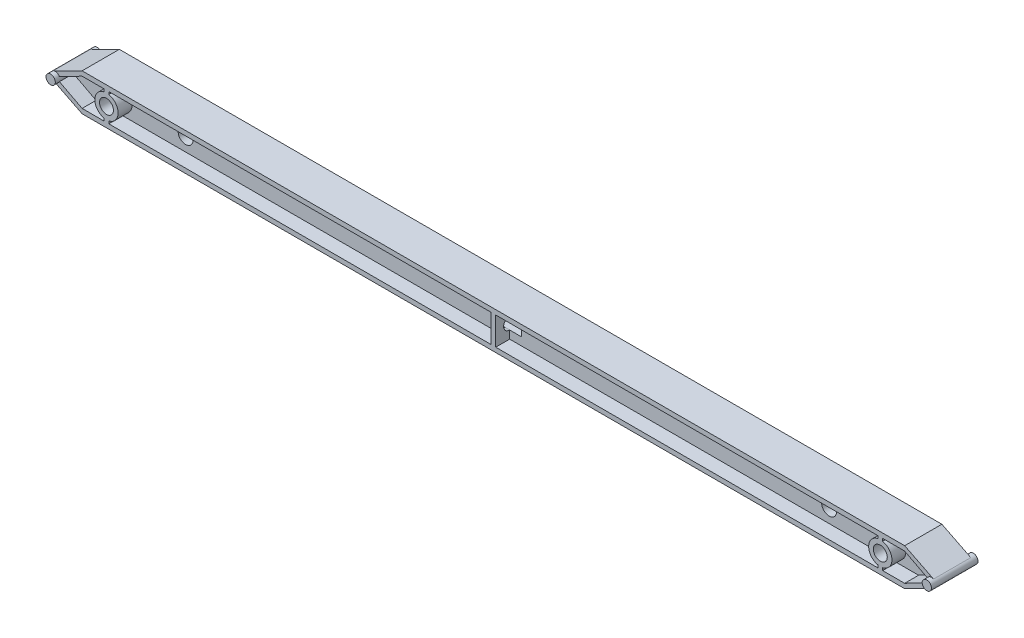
from build123d import *
from build123d.topology import SkipClean

# Parameters (mm, degrees)
SKETCH1_W           = 224.52581246
SKETCH1_H           = 5.08
BOSS_EXTRUDE3_DEPTH = 10.16
CUT_EXTRUDE1_DEPTH  = 3.81
BOSS_EXTRUDE4_START = 1.27
SKETCH6_R           = 1.27
BOSS_EXTRUDE4_DEPTH = 1.27
CUT_EXTRUDE2_DEPTH  = 171.591243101
SKETCH9_R           = 1.27
BOSS_EXTRUDE5_DEPTH = 1.27
CUT_EXTRUDE3_START  = -3.81
CUT_EXTRUDE3_DEPTH  = 3.81
SKETCH11_R          = 1.905
SKETCH11_R_2        = 2.032
SKETCH11_W          = 7.62
SKETCH11_H          = 3.302
CUT_EXTRUDE5_DEPTH  = 169.891306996
BOSS_EXTRUDE6_START = 3.81
SKETCH12_R          = 1.905
SKETCH12_W          = 1.27
SKETCH12_H          = 7.62
BOSS_EXTRUDE6_DEPTH = 3.81
SKETCH13_R          = 1.651
CUT_EXTRUDE6_DEPTH  = 3.81
BOSS_EXTRUDE7_DEPTH = 3.81


with BuildPart() as part:
    # Sketch1 → Boss-Extrude3 (new body)
    with BuildSketch(Plane.XY):
        Polygon((-64.473180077, 5.08), (-74.633180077, 0), (-64.473180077, 0), align=None)
        Polygon((-64.473180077, 0), (-74.633180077, 0), (-64.473180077, -5.08), align=None)
        with Locations((47.789726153, 2.54)):
            Rectangle(SKETCH1_W, SKETCH1_H)
        with Locations((47.789726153, -2.54)):
            Rectangle(SKETCH1_W, SKETCH1_H)
        Polygon((170.212632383, 0), (160.052632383, 0), (160.052632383, -5.08), align=None)
        Polygon((160.052632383, 5.08), (160.052632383, 0), (170.212632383, 0), align=None)
    extrude(amount=BOSS_EXTRUDE3_DEPTH)

    # Sketch4 → Cut-Extrude1 (cut)
    with BuildSketch(Plane.XY.offset(10.16)):
        with BuildLine():
            Line((166.246281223, 0.586341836), (160.052632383, 3.81))
            Line((160.052632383, 3.81), (-64.473180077, 3.81))
            Line((-64.473180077, 3.81), (-70.666828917, 0.586341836))
            ThreePointArc((-70.666828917, 0.586341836), (-70.559758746, 0.301817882), (-70.523373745, 0))
            ThreePointArc((-70.523373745, 0), (-70.559758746, -0.301817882), (-70.666828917, -0.586341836))
            Line((-70.666828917, -0.586341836), (-64.473180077, -3.81))
            Line((-64.473180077, -3.81), (160.052632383, -3.81))
            Line((160.052632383, -3.81), (166.246281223, -0.586341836))
            ThreePointArc((166.246281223, -0.586341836), (166.102826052, 0), (166.246281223, 0.586341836))
        make_face()
    extrude(amount=-CUT_EXTRUDE1_DEPTH, mode=Mode.SUBTRACT)

    # Sketch6 → Boss-Extrude4 (add)
    with SkipClean():  # the faces are left unmerged after this step: merging them gives an invalid solid
        with BuildSketch(Plane.XY.offset(10.16).offset(BOSS_EXTRUDE4_START)):
            with Locations((-71.793373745, 0)):
                Circle(SKETCH6_R)
            with Locations((167.372826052, 0)):
                Circle(SKETCH6_R)
        extrude(amount=-BOSS_EXTRUDE4_DEPTH)

    # Sketch7 → Cut-Extrude2 (cut, through all)
    with SkipClean():  # the faces are left unmerged after this step: merging them gives an invalid solid
        with BuildSketch(Plane.XY.offset(10.16)):
            with BuildLine():
                Line((170.212632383, 0), (167.940787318, 1.135922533))
                ThreePointArc((167.940787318, 1.135922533), (168.642826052, 0), (167.940787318, -1.135922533))
                Line((167.940787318, -1.135922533), (170.212632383, 0))
            make_face()
            with BuildLine():
                Line((-72.361335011, 1.135922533), (-74.633180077, 0))
                Line((-74.633180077, 0), (-72.361335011, -1.135922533))
                ThreePointArc((-72.361335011, -1.135922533), (-73.063373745, 0), (-72.361335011, 1.135922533))
            make_face()
        extrude(amount=-CUT_EXTRUDE2_DEPTH, mode=Mode.SUBTRACT)

    # Sketch9 → Boss-Extrude5 (add)
    with BuildSketch(Plane(origin=(0, 0, 0), x_dir=(-1, 0, 0), z_dir=(0, 0, -1))):
        with Locations(Location((-167.372826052, 0, 0), (0, 0, 180))):
            Circle(SKETCH9_R)
        with Locations(Location((71.793373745, 0, 0), (0, 0, 180))):
            Circle(SKETCH9_R)
    extrude(amount=BOSS_EXTRUDE5_DEPTH)

    # Sketch10 → Cut-Extrude3 (cut)
    with SkipClean():  # the faces are left unmerged after this step: merging them gives an invalid solid
        with BuildSketch(Plane(origin=(0, 0, 0), x_dir=(-1, 0, 0), z_dir=(0, 0, -1)).offset(CUT_EXTRUDE3_START)):
            with BuildLine():
                Line((64.473180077, 3.81), (-160.052632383, 3.81))
                Line((-160.052632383, 3.81), (-166.102826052, 1e-09))
                Line((-166.102826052, -1e-09), (-160.052632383, -3.81))
                Line((-160.052632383, -3.81), (64.473180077, -3.81))
                Line((64.473180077, -3.81), (70.666828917, -0.586341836))
                ThreePointArc((70.666828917, -0.586341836), (70.559758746, -0.301817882), (70.523373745, 0))
                ThreePointArc((70.523373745, 0), (70.559758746, 0.301817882), (70.666828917, 0.586341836))
                Line((70.666828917, 0.586341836), (64.473180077, 3.81))
            make_face()
        extrude(amount=CUT_EXTRUDE3_DEPTH, mode=Mode.SUBTRACT)

    # Sketch11 → Cut-Extrude5 (cut, through all)
    with SkipClean():  # the faces are left unmerged after this step: merging them gives an invalid solid
        with BuildSketch(Plane.XY.offset(6.35)):
            with Locations((-57.823373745, 0)):
                Circle(SKETCH11_R)
            with Locations((153.402826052, 0)):
                Circle(SKETCH11_R)
            with Locations((135.622826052, 0)):
                Circle(SKETCH11_R_2)
            with Locations((47.789726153, 0)):
                Rectangle(SKETCH11_W, SKETCH11_H)
            with Locations((-40.043373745, 0)):
                Circle(SKETCH11_R_2)
        extrude(amount=-CUT_EXTRUDE5_DEPTH, mode=Mode.SUBTRACT)

    # Sketch12 → Boss-Extrude6 (add)
    # profile 1 of 3: a face of its own
    with SkipClean():  # the faces are left unmerged after this step: merging them gives an invalid solid
        with BuildSketch(Plane.XY.offset(6.35).offset(BOSS_EXTRUDE6_START)):
            with BuildLine():
                Line((-57.188373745, 3.81), (-58.458373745, 3.81))
                Line((-58.458373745, 3.81), (-58.458373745, 3.110851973))
                ThreePointArc((-58.458373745, 3.110851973), (-60.998373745, 0), (-58.458373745, -3.110851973))
                Line((-58.458373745, -3.110851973), (-58.458373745, -3.81))
                Line((-58.458373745, -3.81), (-57.188373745, -3.81))
                Line((-57.188373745, -3.81), (-57.188373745, -3.110851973))
                ThreePointArc((-57.188373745, -3.110851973), (-54.648373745, 0), (-57.188373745, 3.110851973))
                Line((-57.188373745, 3.110851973), (-57.188373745, 3.81))
            make_face()
            with Locations((-57.823373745, 0)):
                Circle(SKETCH12_R, mode=Mode.SUBTRACT)
        # profile 2 of 3: a face of its own
        with BuildSketch(Plane.XY.offset(6.35).offset(BOSS_EXTRUDE6_START)):
            with Locations((47.789726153, 0)):
                Rectangle(SKETCH12_W, SKETCH12_H)
        # profile 3 of 3: a face of its own
        with BuildSketch(Plane.XY.offset(6.35).offset(BOSS_EXTRUDE6_START)):
            with BuildLine():
                Line((154.037826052, 3.81), (152.767826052, 3.81))
                Line((152.767826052, 3.81), (152.767826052, 3.110851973))
                ThreePointArc((152.767826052, 3.110851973), (150.227826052, 0), (152.767826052, -3.110851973))
                Line((152.767826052, -3.110851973), (152.767826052, -3.81))
                Line((152.767826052, -3.81), (154.037826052, -3.81))
                Line((154.037826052, -3.81), (154.037826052, -3.110851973))
                ThreePointArc((154.037826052, -3.110851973), (156.577826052, 0), (154.037826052, 3.110851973))
                Line((154.037826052, 3.110851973), (154.037826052, 3.81))
            make_face()
            with Locations((153.402826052, 0)):
                Circle(SKETCH12_R, mode=Mode.SUBTRACT)
        extrude(amount=-BOSS_EXTRUDE6_DEPTH)

    # Sketch13 → Cut-Extrude6 (cut)
    with SkipClean():  # the faces are left unmerged after this step: merging them gives an invalid solid
        with BuildSketch(Plane.ZY.offset(-47.154726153)):
            with Locations((6.35, 0)):
                Circle(SKETCH13_R)
        extrude(amount=-CUT_EXTRUDE6_DEPTH, mode=Mode.SUBTRACT)

    # Sketch14 → Boss-Extrude7 (add)
    with SkipClean():  # the faces are left unmerged after this step: merging them gives an invalid solid
        with BuildSketch(Plane(origin=(0, 0, 3.81), x_dir=(-1, 0, 0), z_dir=(0, 0, -1))):
            with BuildLine():
                Line((58.458373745, 3.81), (57.188373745, 3.81))
                Line((57.188373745, 3.81), (57.188373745, 3.110851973))
                ThreePointArc((57.188373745, 3.110851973), (57.823373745, 3.175), (58.458373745, 3.110851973))
                Line((58.458373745, 3.110851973), (58.458373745, 3.81))
            make_face()
            with BuildLine():
                ThreePointArc((58.458373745, 3.110851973), (57.823373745, 3.175), (57.188373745, 3.110851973))
                Line((57.188373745, 3.110851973), (57.188373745, 1.796051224))
                ThreePointArc((57.188373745, 1.796051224), (57.823373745, 1.905), (58.458373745, 1.796051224))
                Line((58.458373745, 1.796051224), (58.458373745, 3.110851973))
            make_face()
            with BuildLine():
                Line((57.188373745, -1.796051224), (57.188373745, -3.110851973))
                ThreePointArc((57.188373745, -3.110851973), (57.823373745, -3.175), (58.458373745, -3.110851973))
                Line((58.458373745, -3.110851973), (58.458373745, -1.796051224))
                ThreePointArc((58.458373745, -1.796051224), (57.823373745, -1.905), (57.188373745, -1.796051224))
            make_face()
            with BuildLine():
                Line((57.188373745, 1.796051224), (57.188373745, 3.110851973))
                ThreePointArc((57.188373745, 3.110851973), (54.648373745, 0), (57.188373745, -3.110851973))
                Line((57.188373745, -3.110851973), (57.188373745, -1.796051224))
                ThreePointArc((57.188373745, -1.796051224), (55.918373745, 0), (57.188373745, 1.796051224))
            make_face()
            with BuildLine():
                ThreePointArc((60.998373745, 0), (60.28271817, 2.008046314), (58.458373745, 3.110851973))
                Line((58.458373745, 3.110851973), (58.458373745, 1.796051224))
                ThreePointArc((58.458373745, 1.796051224), (59.378799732, 1.099852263), (59.728373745, 0))
                ThreePointArc((59.728373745, 0), (59.378799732, -1.099852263), (58.458373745, -1.796051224))
                Line((58.458373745, -1.796051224), (58.458373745, -3.110851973))
                ThreePointArc((58.458373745, -3.110851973), (60.28271817, -2.008046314), (60.998373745, 0))
            make_face()
            with BuildLine():
                ThreePointArc((58.458373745, 3.110851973), (57.823373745, 3.175), (57.188373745, 3.110851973))
                Line((57.188373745, 3.110851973), (57.188373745, 1.796051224))
                ThreePointArc((57.188373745, 1.796051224), (57.823373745, 1.905), (58.458373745, 1.796051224))
                Line((58.458373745, 1.796051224), (58.458373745, 3.110851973))
            make_face()
            with BuildLine():
                Line((57.188373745, -1.796051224), (57.188373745, -3.110851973))
                ThreePointArc((57.188373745, -3.110851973), (57.823373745, -3.175), (58.458373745, -3.110851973))
                Line((58.458373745, -3.110851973), (58.458373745, -1.796051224))
                ThreePointArc((58.458373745, -1.796051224), (57.823373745, -1.905), (57.188373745, -1.796051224))
            make_face()
            with BuildLine():
                ThreePointArc((58.458373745, -3.110851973), (57.823373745, -3.175), (57.188373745, -3.110851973))
                Line((57.188373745, -3.110851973), (57.188373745, -3.81))
                Line((57.188373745, -3.81), (58.458373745, -3.81))
                Line((58.458373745, -3.81), (58.458373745, -3.110851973))
            make_face()
            with BuildLine():
                Line((-152.767826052, 3.81), (-154.037826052, 3.81))
                Line((-154.037826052, 3.81), (-154.037826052, 3.110851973))
                ThreePointArc((-154.037826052, 3.110851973), (-153.402826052, 3.175), (-152.767826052, 3.110851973))
                Line((-152.767826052, 3.110851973), (-152.767826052, 3.81))
            make_face()
            with BuildLine():
                ThreePointArc((-152.767826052, 3.110851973), (-153.402826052, 3.175), (-154.037826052, 3.110851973))
                Line((-154.037826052, 3.110851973), (-154.037826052, 1.796051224))
                ThreePointArc((-154.037826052, 1.796051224), (-153.402826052, 1.905), (-152.767826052, 1.796051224))
                Line((-152.767826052, 1.796051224), (-152.767826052, 3.110851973))
            make_face()
            with BuildLine():
                Line((-154.037826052, -1.796051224), (-154.037826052, -3.110851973))
                ThreePointArc((-154.037826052, -3.110851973), (-153.402826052, -3.175), (-152.767826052, -3.110851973))
                Line((-152.767826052, -3.110851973), (-152.767826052, -1.796051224))
                ThreePointArc((-152.767826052, -1.796051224), (-153.402826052, -1.905), (-154.037826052, -1.796051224))
            make_face()
            with BuildLine():
                Line((-154.037826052, 1.796051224), (-154.037826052, 3.110851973))
                ThreePointArc((-154.037826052, 3.110851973), (-156.577826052, 0), (-154.037826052, -3.110851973))
                Line((-154.037826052, -3.110851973), (-154.037826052, -1.796051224))
                ThreePointArc((-154.037826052, -1.796051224), (-155.307826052, 0), (-154.037826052, 1.796051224))
            make_face()
            with BuildLine():
                ThreePointArc((-152.767826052, 3.110851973), (-153.402826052, 3.175), (-154.037826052, 3.110851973))
                Line((-154.037826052, 3.110851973), (-154.037826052, 1.796051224))
                ThreePointArc((-154.037826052, 1.796051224), (-153.402826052, 1.905), (-152.767826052, 1.796051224))
                Line((-152.767826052, 1.796051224), (-152.767826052, 3.110851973))
            make_face()
            with BuildLine():
                Line((-154.037826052, -1.796051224), (-154.037826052, -3.110851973))
                ThreePointArc((-154.037826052, -3.110851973), (-153.402826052, -3.175), (-152.767826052, -3.110851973))
                Line((-152.767826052, -3.110851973), (-152.767826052, -1.796051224))
                ThreePointArc((-152.767826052, -1.796051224), (-153.402826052, -1.905), (-154.037826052, -1.796051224))
            make_face()
            with BuildLine():
                ThreePointArc((-152.767826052, -3.110851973), (-153.402826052, -3.175), (-154.037826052, -3.110851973))
                Line((-154.037826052, -3.110851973), (-154.037826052, -3.81))
                Line((-154.037826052, -3.81), (-152.767826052, -3.81))
                Line((-152.767826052, -3.81), (-152.767826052, -3.110851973))
            make_face()
            with BuildLine():
                ThreePointArc((-150.227826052, 0), (-150.943481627, 2.008046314), (-152.767826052, 3.110851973))
                Line((-152.767826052, 3.110851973), (-152.767826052, 1.796051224))
                ThreePointArc((-152.767826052, 1.796051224), (-151.847400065, 1.099852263), (-151.497826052, 0))
                ThreePointArc((-151.497826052, 0), (-151.847400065, -1.099852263), (-152.767826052, -1.796051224))
                Line((-152.767826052, -1.796051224), (-152.767826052, -3.110851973))
                ThreePointArc((-152.767826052, -3.110851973), (-150.943481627, -2.008046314), (-150.227826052, 0))
            make_face()
        extrude(amount=BOSS_EXTRUDE7_DEPTH)


solid = part.part
